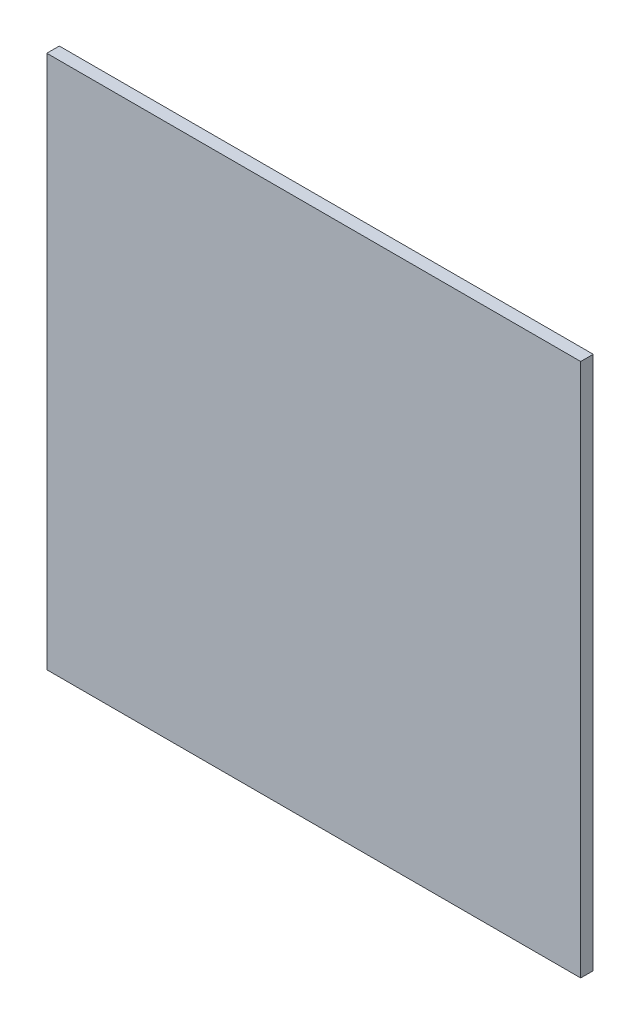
from build123d import *

# Parameters (mm, degrees)
SKETCH1_W      = 406.4
SKETCH1_H      = 406.4
EXTRUDE1_DEPTH = 9.525


with BuildPart() as part:
    # Sketch1 → Extrude1 (new body)
    with BuildSketch(Plane.XY):
        with Locations((203.2, 203.2)):
            Rectangle(SKETCH1_W, SKETCH1_H)
    extrude(amount=EXTRUDE1_DEPTH)


solid = part.part
